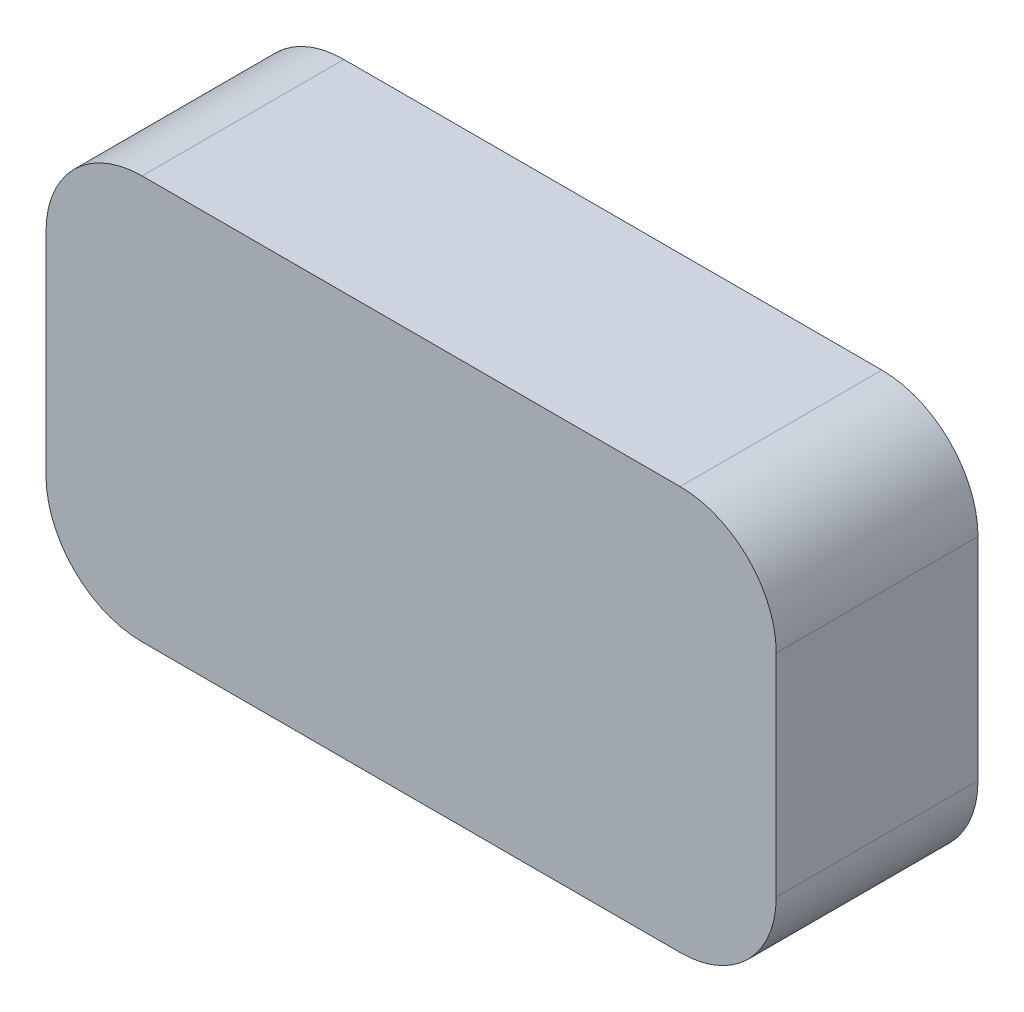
from build123d import *

# Parameters (mm, degrees)
BOSS_EXTRUDE1_DEPTH = 3
BOSS_EXTRUDE2_DEPTH = 100
BOSS_EXTRUDE3_DEPTH = 2


with BuildPart() as part:
    # Sketch1 → Boss-Extrude1 (new body)
    with BuildSketch(Plane.XY):
        with BuildLine():
            Line((140, 115), (-140, 115))
            ThreePointArc((-140, 115), (-175.355339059, 100.355339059), (-190, 65))
            Line((-190, 65), (-190, -45))
            ThreePointArc((-190, -45), (-175.355339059, -80.355339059), (-140, -95))
            Line((-140, -95), (140, -95))
            ThreePointArc((140, -95), (175.355339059, -80.355339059), (190, -45))
            Line((190, -45), (190, 65))
            ThreePointArc((190, 65), (175.355339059, 100.355339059), (140, 115))
        make_face()
    extrude(amount=BOSS_EXTRUDE1_DEPTH)

    # Sketch2 → Boss-Extrude2 (add)
    with BuildSketch(Plane.XY.offset(3)):
        with BuildLine():
            Line((140, 115), (-140, 115))
            ThreePointArc((-140, 115), (-175.355339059, 100.355339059), (-190, 65))
            Line((-190, 65), (-190, -45))
            ThreePointArc((-190, -45), (-175.355339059, -80.355339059), (-140, -95))
            Line((-140, -95), (140, -95))
            ThreePointArc((140, -95), (175.355339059, -80.355339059), (190, -45))
            Line((190, -45), (190, 65))
            ThreePointArc((190, 65), (175.355339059, 100.355339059), (140, 115))
        make_face()
        with BuildLine():
            Line((140, 113), (-140, 113))
            ThreePointArc((-140, 113), (-173.941125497, 98.941125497), (-188, 65))
            Line((-188, 65), (-188, -45))
            ThreePointArc((-188, -45), (-173.941125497, -78.941125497), (-140, -93))
            Line((-140, -93), (140, -93))
            ThreePointArc((140, -93), (173.941125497, -78.941125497), (188, -45))
            Line((188, -45), (188, 65))
            ThreePointArc((188, 65), (173.941125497, 98.941125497), (140, 113))
        make_face(mode=Mode.SUBTRACT)
    extrude(amount=BOSS_EXTRUDE2_DEPTH)

    # Sketch3 → Boss-Extrude3 (add)
    with BuildSketch(Plane.XY.offset(103)):
        with BuildLine():
            Line((140, 115), (-140, 115))
            ThreePointArc((-140, 115), (-175.355339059, 100.355339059), (-190, 65))
            Line((-190, 65), (-190, -45))
            ThreePointArc((-190, -45), (-175.355339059, -80.355339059), (-140, -95))
            Line((-140, -95), (140, -95))
            ThreePointArc((140, -95), (175.355339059, -80.355339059), (190, -45))
            Line((190, -45), (190, 65))
            ThreePointArc((190, 65), (175.355339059, 100.355339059), (140, 115))
        make_face()
    extrude(amount=BOSS_EXTRUDE3_DEPTH)


solid = part.part
